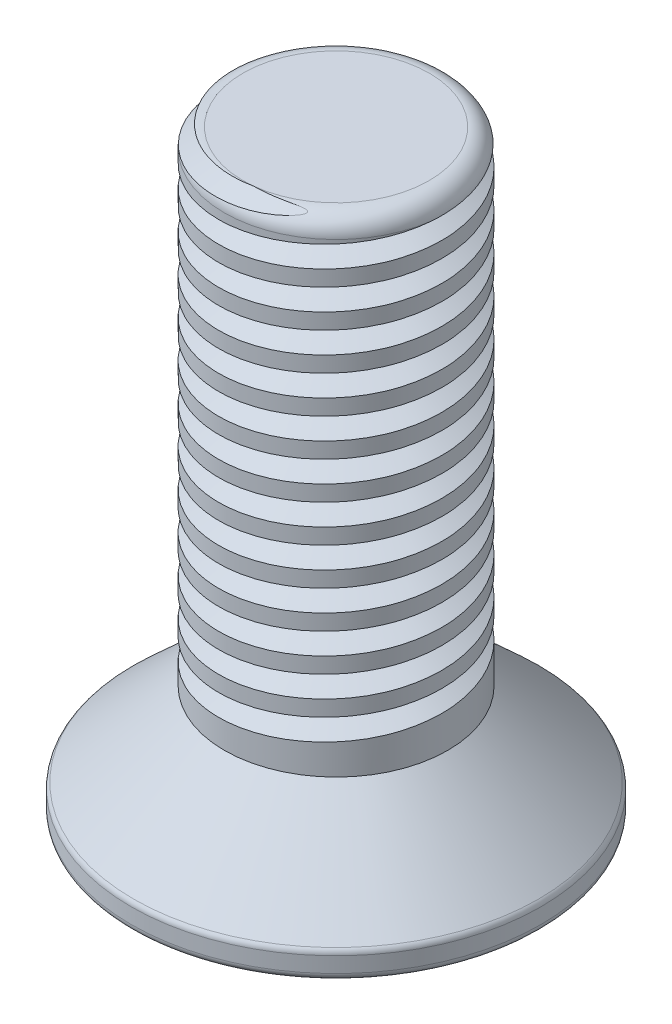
from build123d import *

# Parameters (mm, degrees)
FILLET_1_R          = 0.2
CUT_EXTRUDE_1_DEPTH = 3
SKETCH_3_R          = 3
EXTRUDE_1_DEPTH     = 13
FILLET_2_R          = 0.5
SWEEP_1_PITCH       = 1
SWEEP_1_HEIGHT      = 13.5
SWEEP_1_RADIUS      = 2.5
SWEEP_1_START_ANGLE = 90


with BuildPart() as part:
    # Sketch 1 → Revolve 1 (revolve)
    with BuildSketch(Plane.XY, mode=Mode.PRIVATE) as revolve_1_sk:
        Polygon((0, 3), (3, 3), (5.5, 0.7), (5.5, 0), (0, 0), align=None)
    revolve(revolve_1_sk.sketch.rotate(Axis((0, 0, 0), (0, 1, 0)), 90), axis=Axis((0, 0, 0), (0, 1, 0)))

    # Fillet 1
    fillet_1_edges = [part.edges().sort_by_distance(p)[0] for p in [
        (0, 0, 5.5),
        (0, 0.7, 5.5),
    ]]
    fillet(fillet_1_edges, radius=FILLET_1_R)

    # Sketch 2 → Cut-Extrude 1 (cut)
    with BuildSketch(Plane.XZ):
        Polygon((2.303771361, -0.161154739), (1.291449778, 1.914547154), (-1.012321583, 2.075701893), (-2.303771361, 0.161154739), (-1.291449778, -1.914547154), (1.012321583, -2.075701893), align=None)
    extrude(amount=-CUT_EXTRUDE_1_DEPTH, mode=Mode.SUBTRACT)

    # Sketch 3 → Extrude 1 (add)
    with BuildSketch(Plane(origin=(0, 3, 0), x_dir=(1, 0, 0), z_dir=(0, 1, 0))):
        with Locations(Location((0, 0, 0), (0, 0, 90))):
            Circle(SKETCH_3_R)
    extrude(amount=EXTRUDE_1_DEPTH)

    # Fillet 2
    fillet_2_edges = [part.edges().sort_by_distance(p)[0] for p in [
        (0, 16, 3),
    ]]
    fillet(fillet_2_edges, radius=FILLET_2_R)

    # Sweep 1: sweep along a helix
    with BuildLine() as sweep_1_path:
        add(Helix(SWEEP_1_PITCH, SWEEP_1_HEIGHT, SWEEP_1_RADIUS, center=(0, 16, 0), direction=(0, -1, 0), mode=Mode.PRIVATE).rotate(Axis((0, 16, 0), (0, -1, 0)), SWEEP_1_START_ANGLE))
    # Sketch 5 → Sweep 1 (sweep, cut)
    with BuildSketch(Plane.XY):
        Polygon((2.5, 17.233185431), (3.25, 16.80017273), (3.25, 17.666198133), align=None)
    sweep(path=sweep_1_path.line, is_frenet=True, mode=Mode.SUBTRACT)


solid = part.part
